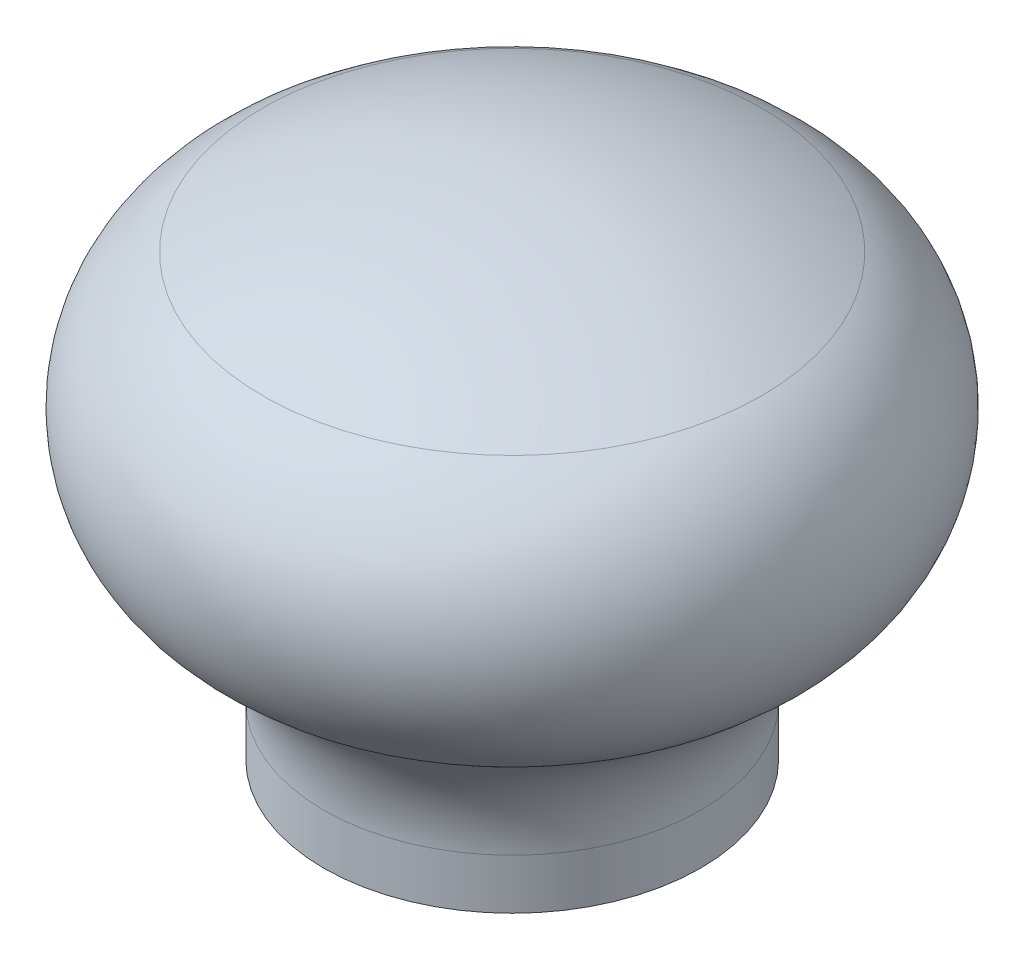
ISO-10303-21;
HEADER;
FILE_DESCRIPTION(('STEP AP214'),'2;1');
FILE_NAME('part.step','',(''),(''),'','','');
FILE_SCHEMA(('AUTOMOTIVE_DESIGN { 1 0 10303 214 1 1 1 1 }'));
ENDSEC;
DATA;
#1=APPLICATION_CONTEXT('core data for automotive mechanical design processes');
#2=APPLICATION_PROTOCOL_DEFINITION('international standard','automotive_design',2000,#1);
#3=PRODUCT_CONTEXT('',#1,'mechanical');
#4=PRODUCT('Part','Part','',(#3));
#5=PRODUCT_RELATED_PRODUCT_CATEGORY('part','',(#4));
#6=PRODUCT_DEFINITION_FORMATION('','',#4);
#7=PRODUCT_DEFINITION_CONTEXT('part definition',#1,'design');
#8=PRODUCT_DEFINITION('design','',#6,#7);
#9=PRODUCT_DEFINITION_SHAPE('','',#8);
#10=(LENGTH_UNIT() NAMED_UNIT(*) SI_UNIT(.MILLI.,.METRE.));
#11=(NAMED_UNIT(*) PLANE_ANGLE_UNIT() SI_UNIT($,.RADIAN.));
#12=(NAMED_UNIT(*) SI_UNIT($,.STERADIAN.) SOLID_ANGLE_UNIT());
#13=UNCERTAINTY_MEASURE_WITH_UNIT(LENGTH_MEASURE(1.E-05),#10,'distance_accuracy_value','');
#14=(GEOMETRIC_REPRESENTATION_CONTEXT(3) GLOBAL_UNCERTAINTY_ASSIGNED_CONTEXT((#13)) GLOBAL_UNIT_ASSIGNED_CONTEXT((#10,
#11,#12)) REPRESENTATION_CONTEXT('',''));
#15=CARTESIAN_POINT('',(0.,0.,0.));
#16=DIRECTION('',(0.,0.,1.));
#17=DIRECTION('',(1.,0.,0.));
#18=AXIS2_PLACEMENT_3D('',#15,#16,#17);
#19=CARTESIAN_POINT('',(0.,15.4309795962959,0.));
#20=DIRECTION('',(0.,-1.,0.));
#21=DIRECTION('',(0.,0.,-1.));
#22=AXIS2_PLACEMENT_3D('',#19,#20,#21);
#23=TOROIDAL_SURFACE('',#22,8.95471716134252,7.71403283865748);
#24=CARTESIAN_POINT('',(0.,8.89,0.));
#25=DIRECTION('',(0.,-1.,0.));
#26=DIRECTION('',(0.,0.,-1.));
#27=AXIS2_PLACEMENT_3D('',#24,#25,#26);
#28=CIRCLE('',#27,13.0439577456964);
#29=CARTESIAN_POINT('',(0.,8.89,-13.0439577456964));
#30=VERTEX_POINT('',#29);
#31=EDGE_CURVE('E10',#30,#30,#28,.T.);
#32=ORIENTED_EDGE('',*,*,#31,.F.);
#33=EDGE_LOOP('',(#32));
#34=FACE_BOUND('',#33,.T.);
#35=CARTESIAN_POINT('',(0.,22.225,0.));
#36=DIRECTION('',(0.,-1.,0.));
#37=DIRECTION('',(0.,0.,-1.));
#38=AXIS2_PLACEMENT_3D('',#35,#36,#37);
#39=CIRCLE('',#38,12.6081524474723);
#40=CARTESIAN_POINT('',(0.,22.225,-12.6081524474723));
#41=VERTEX_POINT('',#40);
#42=EDGE_CURVE('E52',#41,#41,#39,.T.);
#43=ORIENTED_EDGE('',*,*,#42,.T.);
#44=EDGE_LOOP('',(#43));
#45=FACE_BOUND('',#44,.T.);
#46=ADVANCED_FACE('F30',(#34,#45),#23,.T.);
#47=CARTESIAN_POINT('',(0.,2.54,0.));
#48=DIRECTION('',(0.,-1.,0.));
#49=DIRECTION('',(0.,0.,-1.));
#50=AXIS2_PLACEMENT_3D('',#47,#48,#49);
#51=TOROIDAL_SURFACE('',#50,17.0138031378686,7.4888031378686);
#52=CARTESIAN_POINT('',(0.,2.54,0.));
#53=DIRECTION('',(0.,-1.,0.));
#54=DIRECTION('',(0.,0.,-1.));
#55=AXIS2_PLACEMENT_3D('',#52,#53,#54);
#56=CIRCLE('',#55,9.525);
#57=CARTESIAN_POINT('',(0.,2.54,-9.525));
#58=VERTEX_POINT('',#57);
#59=EDGE_CURVE('E36',#58,#58,#56,.T.);
#60=ORIENTED_EDGE('',*,*,#59,.F.);
#61=EDGE_LOOP('',(#60));
#62=FACE_BOUND('',#61,.T.);
#63=ORIENTED_EDGE('',*,*,#31,.T.);
#64=EDGE_LOOP('',(#63));
#65=FACE_BOUND('',#64,.T.);
#66=ADVANCED_FACE('F68',(#62,#65),#51,.F.);
#67=CARTESIAN_POINT('',(0.,0.,0.));
#68=DIRECTION('',(0.,-1.,0.));
#69=DIRECTION('',(0.,0.,-1.));
#70=AXIS2_PLACEMENT_3D('',#67,#68,#69);
#71=CYLINDRICAL_SURFACE('',#70,9.525);
#72=CARTESIAN_POINT('',(0.,0.,0.));
#73=DIRECTION('',(0.,-1.,0.));
#74=DIRECTION('',(0.,0.,-1.));
#75=AXIS2_PLACEMENT_3D('',#72,#73,#74);
#76=CIRCLE('',#75,9.525);
#77=CARTESIAN_POINT('',(0.,0.,-9.525));
#78=VERTEX_POINT('',#77);
#79=EDGE_CURVE('E40',#78,#78,#76,.T.);
#80=ORIENTED_EDGE('',*,*,#79,.F.);
#81=EDGE_LOOP('',(#80));
#82=FACE_BOUND('',#81,.T.);
#83=ORIENTED_EDGE('',*,*,#59,.T.);
#84=EDGE_LOOP('',(#83));
#85=FACE_BOUND('',#84,.T.);
#86=ADVANCED_FACE('F73',(#82,#85),#71,.T.);
#87=CARTESIAN_POINT('',(-9.525,0.,0.));
#88=DIRECTION('',(0.,1.,0.));
#89=DIRECTION('',(0.,0.,1.));
#90=AXIS2_PLACEMENT_3D('',#87,#88,#89);
#91=PLANE('',#90);
#92=CARTESIAN_POINT('',(0.,0.,0.));
#93=DIRECTION('',(0.,-1.,0.));
#94=DIRECTION('',(0.,0.,-1.));
#95=AXIS2_PLACEMENT_3D('',#92,#93,#94);
#96=CIRCLE('',#95,2.0828);
#97=CARTESIAN_POINT('',(0.,0.,-2.0828));
#98=VERTEX_POINT('',#97);
#99=EDGE_CURVE('E44',#98,#98,#96,.T.);
#100=ORIENTED_EDGE('',*,*,#99,.F.);
#101=EDGE_LOOP('',(#100));
#102=FACE_BOUND('',#101,.T.);
#103=ORIENTED_EDGE('',*,*,#79,.T.);
#104=EDGE_LOOP('',(#103));
#105=FACE_BOUND('',#104,.T.);
#106=ADVANCED_FACE('F78',(#102,#105),#91,.F.);
#107=CARTESIAN_POINT('',(0.,0.,0.));
#108=DIRECTION('',(0.,-1.,0.));
#109=DIRECTION('',(0.,0.,-1.));
#110=AXIS2_PLACEMENT_3D('',#107,#108,#109);
#111=CYLINDRICAL_SURFACE('',#110,2.0828);
#112=CARTESIAN_POINT('',(0.,9.26392220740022,0.));
#113=DIRECTION('',(0.,-1.,0.));
#114=DIRECTION('',(0.,0.,-1.));
#115=AXIS2_PLACEMENT_3D('',#112,#113,#114);
#116=CIRCLE('',#115,2.0828);
#117=CARTESIAN_POINT('',(0.,9.26392220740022,-2.0828));
#118=VERTEX_POINT('',#117);
#119=EDGE_CURVE('E49',#118,#118,#116,.T.);
#120=ORIENTED_EDGE('',*,*,#119,.F.);
#121=EDGE_LOOP('',(#120));
#122=FACE_BOUND('',#121,.T.);
#123=ORIENTED_EDGE('',*,*,#99,.T.);
#124=EDGE_LOOP('',(#123));
#125=FACE_BOUND('',#124,.T.);
#126=ADVANCED_FACE('F64',(#122,#125),#111,.F.);
#127=CARTESIAN_POINT('',(-2.0828,9.26392220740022,0.));
#128=DIRECTION('',(0.,1.,0.));
#129=DIRECTION('',(0.,0.,1.));
#130=AXIS2_PLACEMENT_3D('',#127,#128,#129);
#131=PLANE('',#130);
#132=ORIENTED_EDGE('',*,*,#119,.T.);
#133=EDGE_LOOP('',(#132));
#134=FACE_BOUND('',#133,.T.);
#135=ADVANCED_FACE('F59',(#134),#131,.F.);
#136=CARTESIAN_POINT('',(0.,-1.22143828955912,0.));
#137=DIRECTION('',(0.,-1.,0.));
#138=DIRECTION('',(1.,0.,0.));
#139=AXIS2_PLACEMENT_3D('',#136,#137,#138);
#140=SPHERICAL_SURFACE('',#139,26.6214382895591);
#141=ORIENTED_EDGE('',*,*,#42,.F.);
#142=EDGE_LOOP('',(#141));
#143=FACE_BOUND('',#142,.T.);
#144=ADVANCED_FACE('F57',(#143),#140,.T.);
#145=CLOSED_SHELL('',(#46,#66,#86,#106,#126,#135,#144));
#146=MANIFOLD_SOLID_BREP('B2',#145);
#147=ADVANCED_BREP_SHAPE_REPRESENTATION('',(#18,#146),#14);
#148=SHAPE_DEFINITION_REPRESENTATION(#9,#147);
ENDSEC;
END-ISO-10303-21;
